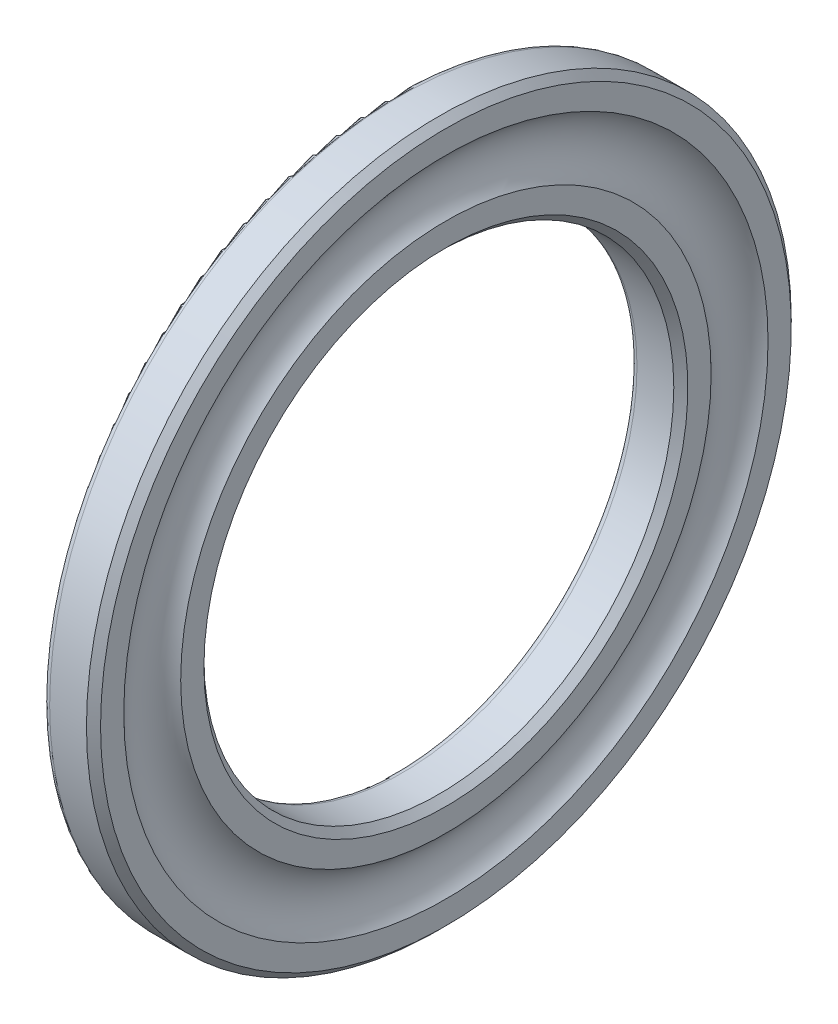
ISO-10303-21;
HEADER;
FILE_DESCRIPTION(('STEP AP214'),'2;1');
FILE_NAME('part.step','',(''),(''),'','','');
FILE_SCHEMA(('AUTOMOTIVE_DESIGN { 1 0 10303 214 1 1 1 1 }'));
ENDSEC;
DATA;
#1=APPLICATION_CONTEXT('core data for automotive mechanical design processes');
#2=APPLICATION_PROTOCOL_DEFINITION('international standard','automotive_design',2000,#1);
#3=PRODUCT_CONTEXT('',#1,'mechanical');
#4=PRODUCT('Part','Part','',(#3));
#5=PRODUCT_RELATED_PRODUCT_CATEGORY('part','',(#4));
#6=PRODUCT_DEFINITION_FORMATION('','',#4);
#7=PRODUCT_DEFINITION_CONTEXT('part definition',#1,'design');
#8=PRODUCT_DEFINITION('design','',#6,#7);
#9=PRODUCT_DEFINITION_SHAPE('','',#8);
#10=(LENGTH_UNIT() NAMED_UNIT(*) SI_UNIT(.MILLI.,.METRE.));
#11=(NAMED_UNIT(*) PLANE_ANGLE_UNIT() SI_UNIT($,.RADIAN.));
#12=(NAMED_UNIT(*) SI_UNIT($,.STERADIAN.) SOLID_ANGLE_UNIT());
#13=UNCERTAINTY_MEASURE_WITH_UNIT(LENGTH_MEASURE(1.E-05),#10,'distance_accuracy_value','');
#14=(GEOMETRIC_REPRESENTATION_CONTEXT(3) GLOBAL_UNCERTAINTY_ASSIGNED_CONTEXT((#13)) GLOBAL_UNIT_ASSIGNED_CONTEXT((#10,
#11,#12)) REPRESENTATION_CONTEXT('',''));
#15=CARTESIAN_POINT('',(0.,0.,0.));
#16=DIRECTION('',(0.,0.,1.));
#17=DIRECTION('',(1.,0.,0.));
#18=AXIS2_PLACEMENT_3D('',#15,#16,#17);
#19=CARTESIAN_POINT('',(0.6,0.,0.));
#20=DIRECTION('',(-1.,0.,0.));
#21=DIRECTION('',(0.,0.,1.));
#22=AXIS2_PLACEMENT_3D('',#19,#20,#21);
#23=TOROIDAL_SURFACE('',#22,20.6,0.6);
#24=CARTESIAN_POINT('',(0.6,0.,0.));
#25=DIRECTION('',(-1.,0.,0.));
#26=DIRECTION('',(0.,0.,1.));
#27=AXIS2_PLACEMENT_3D('',#24,#25,#26);
#28=CIRCLE('',#27,20.);
#29=CARTESIAN_POINT('',(0.6,0.,20.));
#30=VERTEX_POINT('',#29);
#31=EDGE_CURVE('E10',#30,#30,#28,.T.);
#32=ORIENTED_EDGE('',*,*,#31,.F.);
#33=EDGE_LOOP('',(#32));
#34=FACE_BOUND('',#33,.T.);
#35=CARTESIAN_POINT('',(0.,0.,0.));
#36=DIRECTION('',(-1.,0.,0.));
#37=DIRECTION('',(0.,0.,1.));
#38=AXIS2_PLACEMENT_3D('',#35,#36,#37);
#39=CIRCLE('',#38,20.6);
#40=CARTESIAN_POINT('',(0.,0.,20.6));
#41=VERTEX_POINT('',#40);
#42=EDGE_CURVE('E48',#41,#41,#39,.T.);
#43=ORIENTED_EDGE('',*,*,#42,.T.);
#44=EDGE_LOOP('',(#43));
#45=FACE_BOUND('',#44,.T.);
#46=ADVANCED_FACE('F14',(#34,#45),#23,.T.);
#47=CARTESIAN_POINT('',(0.,0.,0.));
#48=DIRECTION('',(-1.,0.,0.));
#49=DIRECTION('',(0.,0.,1.));
#50=AXIS2_PLACEMENT_3D('',#47,#48,#49);
#51=CYLINDRICAL_SURFACE('',#50,20.);
#52=CARTESIAN_POINT('',(3.73333333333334,0.,0.));
#53=DIRECTION('',(-1.,0.,0.));
#54=DIRECTION('',(0.,0.,1.));
#55=AXIS2_PLACEMENT_3D('',#52,#53,#54);
#56=CIRCLE('',#55,20.);
#57=CARTESIAN_POINT('',(3.73333333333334,0.,20.));
#58=VERTEX_POINT('',#57);
#59=EDGE_CURVE('E20',#58,#58,#56,.T.);
#60=ORIENTED_EDGE('',*,*,#59,.F.);
#61=EDGE_LOOP('',(#60));
#62=FACE_BOUND('',#61,.T.);
#63=ORIENTED_EDGE('',*,*,#31,.T.);
#64=EDGE_LOOP('',(#63));
#65=FACE_BOUND('',#64,.T.);
#66=ADVANCED_FACE('F96',(#62,#65),#51,.F.);
#67=CARTESIAN_POINT('',(3.73333333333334,0.,0.));
#68=DIRECTION('',(1.,0.,0.));
#69=DIRECTION('',(0.,0.,-1.));
#70=AXIS2_PLACEMENT_3D('',#67,#68,#69);
#71=CONICAL_SURFACE('',#70,20.,0.78539816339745);
#72=CARTESIAN_POINT('',(4.33333333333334,0.,0.));
#73=DIRECTION('',(-1.,0.,0.));
#74=DIRECTION('',(0.,0.,1.));
#75=AXIS2_PLACEMENT_3D('',#72,#73,#74);
#76=CIRCLE('',#75,20.6);
#77=CARTESIAN_POINT('',(4.33333333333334,0.,20.6));
#78=VERTEX_POINT('',#77);
#79=EDGE_CURVE('E24',#78,#78,#76,.T.);
#80=ORIENTED_EDGE('',*,*,#79,.F.);
#81=EDGE_LOOP('',(#80));
#82=FACE_BOUND('',#81,.T.);
#83=ORIENTED_EDGE('',*,*,#59,.T.);
#84=EDGE_LOOP('',(#83));
#85=FACE_BOUND('',#84,.T.);
#86=ADVANCED_FACE('F92',(#82,#85),#71,.F.);
#87=CARTESIAN_POINT('',(4.33333333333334,20.6,0.));
#88=DIRECTION('',(-1.,0.,0.));
#89=DIRECTION('',(0.,0.,1.));
#90=AXIS2_PLACEMENT_3D('',#87,#88,#89);
#91=PLANE('',#90);
#92=CARTESIAN_POINT('',(4.33333333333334,0.,0.));
#93=DIRECTION('',(-1.,0.,0.));
#94=DIRECTION('',(0.,0.,1.));
#95=AXIS2_PLACEMENT_3D('',#92,#93,#94);
#96=CIRCLE('',#95,22.5775930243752);
#97=CARTESIAN_POINT('',(4.33333333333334,0.,22.5775930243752));
#98=VERTEX_POINT('',#97);
#99=EDGE_CURVE('E28',#98,#98,#96,.T.);
#100=ORIENTED_EDGE('',*,*,#99,.F.);
#101=EDGE_LOOP('',(#100));
#102=FACE_BOUND('',#101,.T.);
#103=ORIENTED_EDGE('',*,*,#79,.T.);
#104=EDGE_LOOP('',(#103));
#105=FACE_BOUND('',#104,.T.);
#106=ADVANCED_FACE('F85',(#102,#105),#91,.F.);
#107=CARTESIAN_POINT('',(6.5,0.,0.));
#108=DIRECTION('',(-1.,0.,0.));
#109=DIRECTION('',(0.,0.,1.));
#110=AXIS2_PLACEMENT_3D('',#107,#108,#109);
#111=TOROIDAL_SURFACE('',#110,25.,3.25);
#112=ORIENTED_EDGE('',*,*,#99,.T.);
#113=EDGE_LOOP('',(#112));
#114=FACE_BOUND('',#113,.T.);
#115=CARTESIAN_POINT('',(4.33333333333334,0.,0.));
#116=DIRECTION('',(-1.,0.,0.));
#117=DIRECTION('',(0.,0.,1.));
#118=AXIS2_PLACEMENT_3D('',#115,#116,#117);
#119=CIRCLE('',#118,27.4224069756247);
#120=CARTESIAN_POINT('',(4.33333333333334,0.,27.4224069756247));
#121=VERTEX_POINT('',#120);
#122=EDGE_CURVE('E33',#121,#121,#119,.T.);
#123=ORIENTED_EDGE('',*,*,#122,.F.);
#124=EDGE_LOOP('',(#123));
#125=FACE_BOUND('',#124,.T.);
#126=ADVANCED_FACE('F80',(#114,#125),#111,.F.);
#127=CARTESIAN_POINT('',(4.33333333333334,27.4224069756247,0.));
#128=DIRECTION('',(-1.,0.,0.));
#129=DIRECTION('',(0.,0.,1.));
#130=AXIS2_PLACEMENT_3D('',#127,#128,#129);
#131=PLANE('',#130);
#132=CARTESIAN_POINT('',(4.33333333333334,0.,0.));
#133=DIRECTION('',(-1.,0.,0.));
#134=DIRECTION('',(0.,0.,1.));
#135=AXIS2_PLACEMENT_3D('',#132,#133,#134);
#136=CIRCLE('',#135,29.4);
#137=CARTESIAN_POINT('',(4.33333333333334,0.,29.4));
#138=VERTEX_POINT('',#137);
#139=EDGE_CURVE('E36',#138,#138,#136,.T.);
#140=ORIENTED_EDGE('',*,*,#139,.F.);
#141=EDGE_LOOP('',(#140));
#142=FACE_BOUND('',#141,.T.);
#143=ORIENTED_EDGE('',*,*,#122,.T.);
#144=EDGE_LOOP('',(#143));
#145=FACE_BOUND('',#144,.T.);
#146=ADVANCED_FACE('F74',(#142,#145),#131,.F.);
#147=CARTESIAN_POINT('',(4.33333333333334,0.,0.));
#148=DIRECTION('',(-1.,0.,0.));
#149=DIRECTION('',(0.,0.,1.));
#150=AXIS2_PLACEMENT_3D('',#147,#148,#149);
#151=CONICAL_SURFACE('',#150,29.4,0.785398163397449);
#152=CARTESIAN_POINT('',(3.73333333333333,0.,0.));
#153=DIRECTION('',(-1.,0.,0.));
#154=DIRECTION('',(0.,0.,1.));
#155=AXIS2_PLACEMENT_3D('',#152,#153,#154);
#156=CIRCLE('',#155,30.);
#157=CARTESIAN_POINT('',(3.73333333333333,0.,30.));
#158=VERTEX_POINT('',#157);
#159=EDGE_CURVE('E39',#158,#158,#156,.T.);
#160=ORIENTED_EDGE('',*,*,#159,.F.);
#161=EDGE_LOOP('',(#160));
#162=FACE_BOUND('',#161,.T.);
#163=ORIENTED_EDGE('',*,*,#139,.T.);
#164=EDGE_LOOP('',(#163));
#165=FACE_BOUND('',#164,.T.);
#166=ADVANCED_FACE('F68',(#162,#165),#151,.T.);
#167=CARTESIAN_POINT('',(0.,0.,0.));
#168=DIRECTION('',(-1.,0.,0.));
#169=DIRECTION('',(0.,0.,1.));
#170=AXIS2_PLACEMENT_3D('',#167,#168,#169);
#171=CYLINDRICAL_SURFACE('',#170,30.);
#172=CARTESIAN_POINT('',(0.6,0.,0.));
#173=DIRECTION('',(-1.,0.,0.));
#174=DIRECTION('',(0.,0.,1.));
#175=AXIS2_PLACEMENT_3D('',#172,#173,#174);
#176=CIRCLE('',#175,30.);
#177=CARTESIAN_POINT('',(0.6,0.,30.));
#178=VERTEX_POINT('',#177);
#179=EDGE_CURVE('E42',#178,#178,#176,.T.);
#180=ORIENTED_EDGE('',*,*,#179,.F.);
#181=EDGE_LOOP('',(#180));
#182=FACE_BOUND('',#181,.T.);
#183=ORIENTED_EDGE('',*,*,#159,.T.);
#184=EDGE_LOOP('',(#183));
#185=FACE_BOUND('',#184,.T.);
#186=ADVANCED_FACE('F62',(#182,#185),#171,.T.);
#187=CARTESIAN_POINT('',(0.6,0.,0.));
#188=DIRECTION('',(-1.,0.,0.));
#189=DIRECTION('',(0.,0.,1.));
#190=AXIS2_PLACEMENT_3D('',#187,#188,#189);
#191=TOROIDAL_SURFACE('',#190,29.4,0.6);
#192=CARTESIAN_POINT('',(0.,0.,0.));
#193=DIRECTION('',(-1.,0.,0.));
#194=DIRECTION('',(0.,0.,1.));
#195=AXIS2_PLACEMENT_3D('',#192,#193,#194);
#196=CIRCLE('',#195,29.4);
#197=CARTESIAN_POINT('',(0.,0.,29.4));
#198=VERTEX_POINT('',#197);
#199=EDGE_CURVE('E45',#198,#198,#196,.T.);
#200=ORIENTED_EDGE('',*,*,#199,.F.);
#201=EDGE_LOOP('',(#200));
#202=FACE_BOUND('',#201,.T.);
#203=ORIENTED_EDGE('',*,*,#179,.T.);
#204=EDGE_LOOP('',(#203));
#205=FACE_BOUND('',#204,.T.);
#206=ADVANCED_FACE('F56',(#202,#205),#191,.T.);
#207=CARTESIAN_POINT('',(0.,29.4,0.));
#208=DIRECTION('',(1.,0.,0.));
#209=DIRECTION('',(0.,0.,-1.));
#210=AXIS2_PLACEMENT_3D('',#207,#208,#209);
#211=PLANE('',#210);
#212=ORIENTED_EDGE('',*,*,#42,.F.);
#213=EDGE_LOOP('',(#212));
#214=FACE_BOUND('',#213,.T.);
#215=ORIENTED_EDGE('',*,*,#199,.T.);
#216=EDGE_LOOP('',(#215));
#217=FACE_BOUND('',#216,.T.);
#218=ADVANCED_FACE('F53',(#214,#217),#211,.F.);
#219=CLOSED_SHELL('',(#46,#66,#86,#106,#126,#146,#166,#186,#206,#218));
#220=MANIFOLD_SOLID_BREP('B1',#219);
#221=ADVANCED_BREP_SHAPE_REPRESENTATION('',(#18,#220),#14);
#222=SHAPE_DEFINITION_REPRESENTATION(#9,#221);
ENDSEC;
END-ISO-10303-21;
